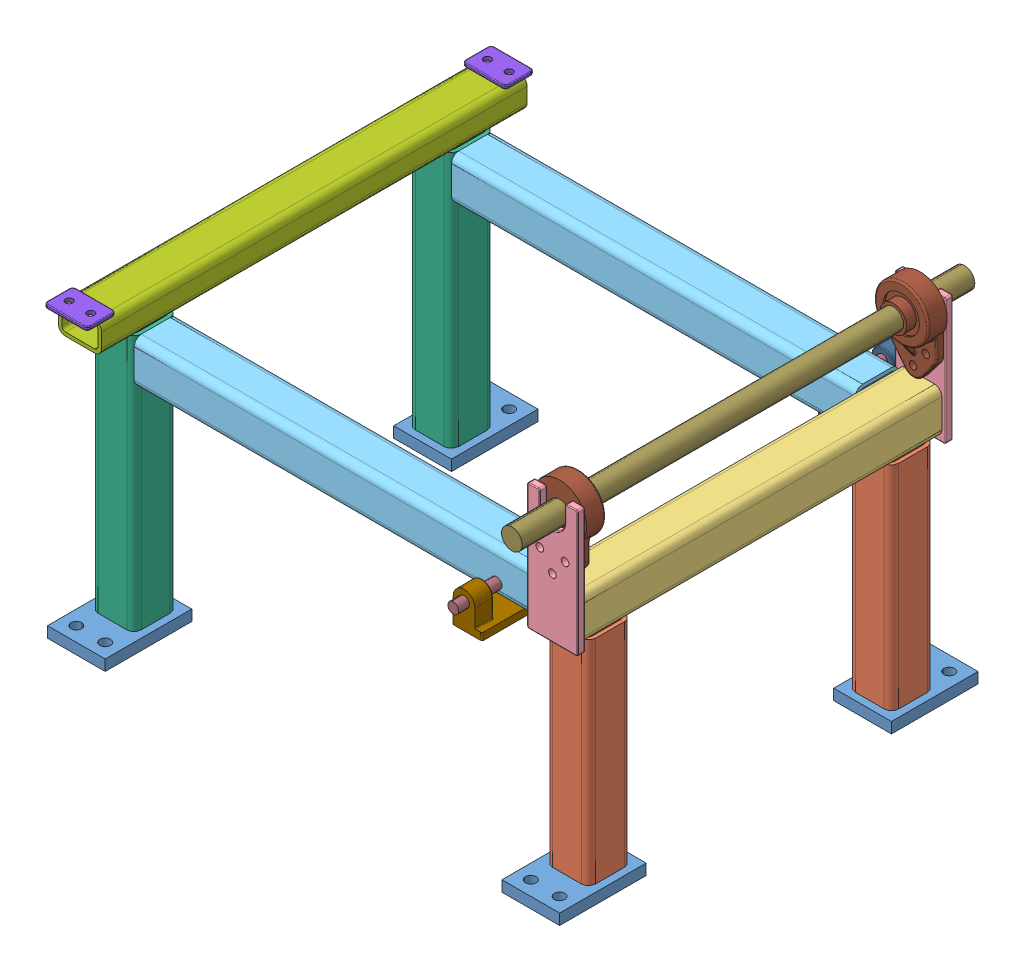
SolidWorks assembly tilt frame.SLDASM, configuration Default (file format 11000). Lengths in mm.
Overall size (889 628.65 806.45).
23 component instances, 13 part files, 63 mates.
Components (placement in the parent):
- supp_base_pl-1: supp_base_pl.SLDPRT [Default] at origin size (101.6 19.05 152.4)
- PIV_V1-1: PIV_V1.SLDPRT [Default] at (50.8 393.7 -101.6) x (1 0 0) z (0 -1 0) size (76.2 76.2 374.65)
- PIV_H2-1: PIV_H2.SLDPRT [Default] at (50.8 431.8 -685.8) x (-1 0 0) z (0 0 1) size (76.2 76.2 635)
- PIV_V1-2: PIV_V1.SLDPRT [Default] at (50.8 19.05 -635) x (1 0 0) z (0 1 0) size (76.2 76.2 374.65)
- supp_base_pl-2: supp_base_pl.SLDPRT [Default] at (101.6 0 -736.6) x (-1 0 0) z (0 0 -1) size (101.6 19.05 152.4)
- SWIVEL PLATE-1: SWIVEL PLATE.SLDPRT [Default] at (6.35 387.35 -50.8) size (88.9 222.25 12.7)
- SWIVEL PLATE-2: SWIVEL PLATE.SLDPRT [Default] at (6.35 387.35 -698.5) size (88.9 222.25 12.7)
- PIV_H1-1: PIV_H1.SLDPRT [Default] at (-698.5 431.8 -88.9) x (0 0 -1) z (1 0 0) size (76.2 76.2 711.2)
- PIV_H1-2: PIV_H1.SLDPRT [Default] at (-698.5 431.8 -647.7) x (0 0 -1) z (1 0 0) size (76.2 76.2 711.2)
- PIV_V2-1: PIV_V2.SLDPRT [Default] at (-736.6 19.05 -88.9) x (0 0 1) z (0 1 0) size (76.2 76.2 450.85)
- PIV_V2-2: PIV_V2.SLDPRT [Default] at (-736.6 469.9 -647.7) x (0 0 1) z (0 -1 0) size (76.2 76.2 450.85)
- supp_base_pl-3: supp_base_pl.SLDPRT [Default] at (-787.4 0 12.7) size (101.6 19.05 152.4)
- supp_base_pl-4: supp_base_pl.SLDPRT [Default] at (-685.8 0 -749.3) x (-1 0 0) z (0 0 -1) size (101.6 19.05 152.4)
- PIV_H3-1: PIV_H3.SLDPRT [Default] at (-736.6 495.3 -742.95) size (76.2 50.8 749.3)
- pivot bumper-1: pivot bumper.SLDPRT [Default] at (-698.5 527.05 -19.05) x (-1 0 0) z (0 0 1) size (76.2 6.35 50.8)
- pivot bumper-2: pivot bumper.SLDPRT [Default] at (-698.5 527.05 -755.65) x (-1 0 0) z (0 0 1) size (76.2 6.35 50.8)
- PISTON_BRACKET_L-1: PISTON_BRACKET_L.SLDPRT [Default] at (-69.85 381 -111.125) size (50.8 63.5 127)
- PISTON_BRACKET_R-1: PISTON_BRACKET_R.SLDPRT [Default] at (-19.05 381 -625.475) x (-1 0 0) z (0 0 -1) size (50.8 63.5 127)
- 3_bolt_flange-2: 3_bolt_flange.SLDPRT [Default] at (50.8 581.025 -685.8) size (95.25 155.58 47.62)
- 3_bolt_flange-1: 3_bolt_flange.SLDPRT [Default] at (50.8 581.025 -50.8) x (-1 0 0) z (0 0 -1) size (95.25 155.58 47.62)
- pivot shaft-1: pivot shaft.SLDPRT [Default] at (50.8 581.025 -365.1123) size (36.53 36.53 796.92)
- pin .75x3.0-1: pin .75x3.0.SLDPRT [Default] at (-50.8 425.45 -41.275) size (19.05 19.05 76.2)
- pin .75x3.0-2: pin .75x3.0.SLDPRT [Default] at (-50.8 425.45 -771.525) x (-0.338255 -0.941055 0) z (0 0 1) size (19.05 19.05 76.2)
Mates (geometry in assembly coordinates):
- Coincident1: coincident: plane of supp_base_pl-1 through (0 19.05 -152.4) normal (0 1 0); plane of PIV_V1-1 through (25.4 19.05 -76.2) normal (0 -1 0)
- Distance1: distance = 12.7 mm: plane of supp_base_pl-1 through (101.6 19.05 -152.4) normal (1 0 0); plane of PIV_V1-1 through (88.9 19.05 -127) normal (1 0 0)
- Distance2: distance = 12.7 mm: plane of supp_base_pl-1 through (101.6 19.05 -152.4) normal (0 0 -1); plane of PIV_V1-1 through (76.2 19.05 -139.7) normal (0 0 -1)
- Coincident2: coincident: plane of PIV_V1-1 through (25.4 393.7 -76.2) normal (0 1 0); plane of PIV_H2-1 through (76.2 393.7 -50.8) normal (0 -1 0)
- Distance3: distance = 12.7 mm: plane of PIV_V1-1 through (25.4 19.05 -63.5) normal (0 0 1); plane of PIV_H2-1 through (76.2 406.4 -50.8) normal (0 0 1)
- Coincident3: coincident: plane of PIV_V1-1 through (88.9 19.05 -127) normal (1 0 0); plane of PIV_H2-1 through (88.9 406.4 -50.8) normal (1 0 0)
- Coincident4: coincident: plane of PIV_H2-1 through (76.2 393.7 -50.8) normal (0 -1 0); plane of PIV_V1-2 through (25.4 393.7 -660.4) normal (0 1 0)
- Coincident5: coincident: plane of PIV_H2-1 through (88.9 406.4 -50.8) normal (1 0 0); plane of PIV_V1-2 through (88.9 393.7 -609.6) normal (1 0 0)
- Distance4: distance = 12.7 mm: plane of PIV_H2-1 through (76.2 406.4 -685.8) normal (0 0 -1); plane of PIV_V1-2 through (25.4 393.7 -673.1) normal (0 0 -1)
- Distance5: distance = 12.7 mm: plane of PIV_V1-2 through (76.2 393.7 -596.9) normal (0 0 1); plane of supp_base_pl-2 through (0 19.05 -584.2) normal (0 0 1)
- Coincident6: coincident: plane of PIV_V1-2 through (25.4 19.05 -660.4) normal (0 -1 0); plane of supp_base_pl-2 through (101.6 19.05 -584.2) normal (0 1 0)
- Distance6: distance = 12.7 mm: plane of PIV_V1-2 through (88.9 393.7 -609.6) normal (1 0 0); plane of supp_base_pl-2 through (101.6 19.05 -736.6) normal (1 0 0)
- Coincident7: coincident: plane of PIV_H2-1 through (76.2 406.4 -50.8) normal (0 0 1); plane of SWIVEL PLATE-1 through (50.8 581.025 -50.8) normal (0 0 -1)
- Distance7: distance = 6.35 mm: plane of PIV_H2-1 through (88.9 406.4 -50.8) normal (1 0 0); plane of SWIVEL PLATE-1 through (95.25 609.6 -38.1) normal (1 0 0)
- Distance8: distance = 6.35 mm: plane of PIV_H2-1 through (76.2 393.7 -50.8) normal (0 -1 0); plane of SWIVEL PLATE-1 through (6.35 387.35 -38.1) normal (0 -1 0)
- Coincident8: coincident: plane of PIV_H2-1 through (76.2 406.4 -685.8) normal (0 0 -1); plane of SWIVEL PLATE-2 through (50.8 581.025 -685.8) normal (0 0 1)
- Distance9: distance = 6.35 mm: plane of PIV_H2-1 through (88.9 406.4 -50.8) normal (1 0 0); plane of SWIVEL PLATE-2 through (95.25 609.6 -685.8) normal (1 0 0)
- Distance10: distance = 6.35 mm: plane of PIV_H2-1 through (76.2 393.7 -50.8) normal (0 -1 0); plane of SWIVEL PLATE-2 through (6.35 387.35 -685.8) normal (0 -1 0)
- Coincident9: coincident: plane of PIV_H2-1 through (12.7 457.2 -50.8) normal (-1 0 0); plane of PIV_H1-1 through (12.7 457.2 -63.5) normal (1 0 0)
- Coincident10: coincident: plane of PIV_H2-1 through (25.4 469.9 -50.8) normal (0 1 0); plane of PIV_H1-1 through (12.7 469.9 -63.5) normal (0 1 0)
- Coincident11: coincident: plane of SWIVEL PLATE-1 through (50.8 581.025 -50.8) normal (0 0 -1); plane of PIV_H1-1 through (12.7 457.2 -50.8) normal (0 0 1)
- Coincident12: coincident: plane of PIV_H2-1 through (12.7 457.2 -50.8) normal (-1 0 0); plane of PIV_H1-2 through (12.7 457.2 -622.3) normal (1 0 0)
- Coincident13: coincident: plane of PIV_H2-1 through (25.4 469.9 -50.8) normal (0 1 0); plane of PIV_H1-2 through (12.7 469.9 -622.3) normal (0 1 0)
- Coincident14: coincident: plane of SWIVEL PLATE-2 through (50.8 581.025 -685.8) normal (0 0 1); plane of PIV_H1-2 through (12.7 406.4 -685.8) normal (0 0 -1)
- Coincident15: coincident: plane of PIV_H1-1 through (-698.5 457.2 -63.5) normal (-1 0 0); plane of PIV_V2-1 through (-698.5 469.9 -114.3) normal (1 0 0)
- Coincident16: coincident: plane of PIV_H1-1 through (12.7 469.9 -63.5) normal (0 1 0); plane of PIV_V2-1 through (-711.2 469.9 -114.3) normal (0 1 0)
- Coincident17: coincident: plane of PIV_H1-1 through (12.7 457.2 -50.8) normal (0 0 1); plane of PIV_V2-1 through (-762 469.9 -50.8) normal (0 0 1)
- Coincident18: coincident: plane of PIV_H1-2 through (12.7 469.9 -622.3) normal (0 1 0); plane of PIV_V2-2 through (-762 469.9 -673.1) normal (0 1 0)
- Coincident19: coincident: plane of PIV_H1-2 through (12.7 457.2 -609.6) normal (0 0 1); plane of PIV_V2-2 through (-711.2 19.05 -609.6) normal (0 0 1)
- Coincident20: coincident: plane of PIV_H1-2 through (-698.5 457.2 -622.3) normal (-1 0 0); plane of PIV_V2-2 through (-698.5 19.05 -622.3) normal (1 0 0)
- Coincident21: coincident: plane of PIV_V2-1 through (-711.2 19.05 -114.3) normal (0 -1 0); plane of supp_base_pl-3 through (-787.4 19.05 -139.7) normal (0 1 0)
- Distance11: distance = 12.7 mm: plane of PIV_V2-1 through (-698.5 469.9 -114.3) normal (1 0 0); plane of supp_base_pl-3 through (-685.8 19.05 -139.7) normal (1 0 0)
- Distance12: distance = 12.7 mm: plane of PIV_V2-1 through (-711.2 469.9 -127) normal (0 0 -1); plane of supp_base_pl-3 through (-685.8 19.05 -139.7) normal (0 0 -1)
- Coincident22: coincident: plane of supp_base_pl-3 through (-787.4 19.05 -139.7) normal (0 1 0); plane of supp_base_pl-4 through (-685.8 19.05 -596.9) normal (0 1 0)
- Distance13: distance = 12.7 mm: plane of PIV_V2-2 through (-711.2 19.05 -609.6) normal (0 0 1); plane of supp_base_pl-4 through (-787.4 19.05 -596.9) normal (0 0 1)
- Distance14: distance = 12.7 mm: plane of PIV_V2-2 through (-698.5 19.05 -622.3) normal (1 0 0); plane of supp_base_pl-4 through (-685.8 19.05 -749.3) normal (1 0 0)
- Coincident23: coincident: plane of PIV_V2-1 through (-711.2 469.9 -114.3) normal (0 1 0); plane of PIV_H3-1 through (-711.2 469.9 6.35) normal (0 -1 0)
- Coincident24: coincident: plane of PIV_V2-1 through (-774.7 469.9 -63.5) normal (-1 0 0); plane of PIV_H3-1 through (-774.7 508 6.35) normal (-1 0 0)
- Distance15: distance = 57.15 mm: plane of PIV_V2-1 through (-762 469.9 -50.8) normal (0 0 1); plane of PIV_H3-1 through (-762 508 6.35) normal (0 0 1)
- Coincident25: coincident: plane of PIV_H3-1 through (-762 520.7 6.35) normal (0 1 0); plane of pivot bumper-1 through (-774.7 520.7 31.75) normal (0 -1 0)
- Coincident26: coincident: plane of PIV_H3-1 through (-698.5 482.6 6.35) normal (1 0 0); plane of pivot bumper-1 through (-698.5 527.05 31.75) normal (1 0 0)
- Distance16: distance = 25.4 mm: plane of PIV_H3-1 through (-762 508 6.35) normal (0 0 1); plane of pivot bumper-1 through (-698.5 527.05 31.75) normal (0 0 1)
- Coincident27: coincident: plane of PIV_H3-1 through (-762 520.7 6.35) normal (0 1 0); plane of pivot bumper-2 through (-774.7 520.7 -704.85) normal (0 -1 0)
- Coincident28: coincident: plane of PIV_H3-1 through (-698.5 482.6 6.35) normal (1 0 0); plane of pivot bumper-2 through (-698.5 527.05 -704.85) normal (1 0 0)
- Distance17: distance = 12.7 mm: plane of PIV_H3-1 through (-762 508 -742.95) normal (0 0 -1); plane of pivot bumper-2 through (-698.5 527.05 -755.65) normal (0 0 -1)
- Coincident29: coincident: plane of PIV_H1-1 through (12.7 393.7 -114.3) normal (0 -1 0); plane of PISTON_BRACKET_L-1 through (-19.05 393.7 15.875) normal (0 1 0)
- Distance18: distance = 107.95 mm: plane of PIV_H2-1 through (88.9 406.4 -50.8) normal (1 0 0); plane of PISTON_BRACKET_L-1 through (-19.05 393.7 15.875) normal (1 0 0)
- Distance19: distance = 66.675 mm: plane of PIV_H1-1 through (12.7 457.2 -50.8) normal (0 0 1); plane of PISTON_BRACKET_L-1 through (-69.85 381 15.875) normal (0 0 1)
- Coincident30: coincident: plane of PIV_H1-2 through (12.7 393.7 -673.1) normal (0 -1 0); plane of PISTON_BRACKET_R-1 through (-69.85 393.7 -752.475) normal (0 1 0)
- Coincident31: coincident: plane of PISTON_BRACKET_L-1 through (-19.05 393.7 15.875) normal (1 0 0); plane of PISTON_BRACKET_R-1 through (-19.05 381 -752.475) normal (1 0 0)
- Distance20: distance = 66.675 mm: plane of PIV_H1-2 through (12.7 406.4 -685.8) normal (0 0 -1); plane of PISTON_BRACKET_R-1 through (-19.05 381 -752.475) normal (0 0 -1)
- Coincident32: coincident: plane of SWIVEL PLATE-2 through (50.8 581.025 -685.8) normal (0 0 1); plane of 3_bolt_flange-2 through (50.8 492.125 -685.8) normal (0 0 -1)
- Concentric1: concentric: cylinder of SWIVEL PLATE-2 through (50.8 581.025 -685.8) axis (0 0 -1) radius 22.225; cylinder of 3_bolt_flange-2 through (50.8 581.025 -685.8) axis (0 0 1) radius 18.2563
- Parallel1: parallel: plane of SWIVEL PLATE-2 through (95.25 609.6 -685.8) normal (1 0 0); plane of 3_bolt_flange-2 through (92.075 521.0892 -673.1) normal (1 0 0)
- Coincident33: coincident: plane of SWIVEL PLATE-1 through (50.8 581.025 -50.8) normal (0 0 -1); plane of 3_bolt_flange-1 through (50.8 492.125 -50.8) normal (0 0 1); plane of SWIVEL PLATE-1; plane of ?
- Concentric2: concentric: cylinder of SWIVEL PLATE-1 through (50.8 581.025 -38.1) axis (0 0 -1) radius 22.225; cylinder of 3_bolt_flange-1 through (50.8 581.025 -50.8) axis (0 0 -1) radius 18.2563
- Parallel2: parallel: plane of SWIVEL PLATE-1 through (95.25 609.6 -38.1) normal (1 0 0); plane of 3_bolt_flange-1 through (92.075 521.0892 -63.5) normal (1 0 0)
- Concentric3: concentric: cylinder of 3_bolt_flange-1 through (50.8 581.025 -50.8) axis (0 0 -1) radius 18.2563; cylinder of pivot shaft-1 through (50.8 581.025 33.3502) axis (0 0 -1) radius 18.2626
- Distance21: distance = 71.4502 mm: plane of SWIVEL PLATE-1 through (50.8 581.025 -38.1) normal (0 0 1); plane of pivot shaft-1 through (50.8 581.025 33.3502) normal (0 0 1)
- Concentric4: concentric: cylinder of PISTON_BRACKET_L-1 through (-50.8 425.45 -111.125) axis (0 0 1) radius 9.525; cylinder of pin .75x3.0-1 through (-50.8 425.45 34.925) axis (0 0 -1) radius 9.525
- Distance22: distance = 19.05 mm: plane of PISTON_BRACKET_L-1 through (-69.85 381 15.875) normal (0 0 1); plane of pin .75x3.0-1 through (-50.8 425.45 34.925) normal (0 0 1)
- Concentric5: concentric: cylinder of PISTON_BRACKET_R-1 through (-50.8 425.45 -625.475) axis (0 0 -1) radius 9.525; cylinder of pin .75x3.0-2 through (-50.8 425.45 -695.325) axis (0 0 -1) radius 9.525
- Distance23: distance = 19.05 mm: plane of PISTON_BRACKET_R-1 through (-19.05 381 -752.475) normal (0 0 -1); plane of pin .75x3.0-2 through (-50.8 425.45 -771.525) normal (0 0 -1)
